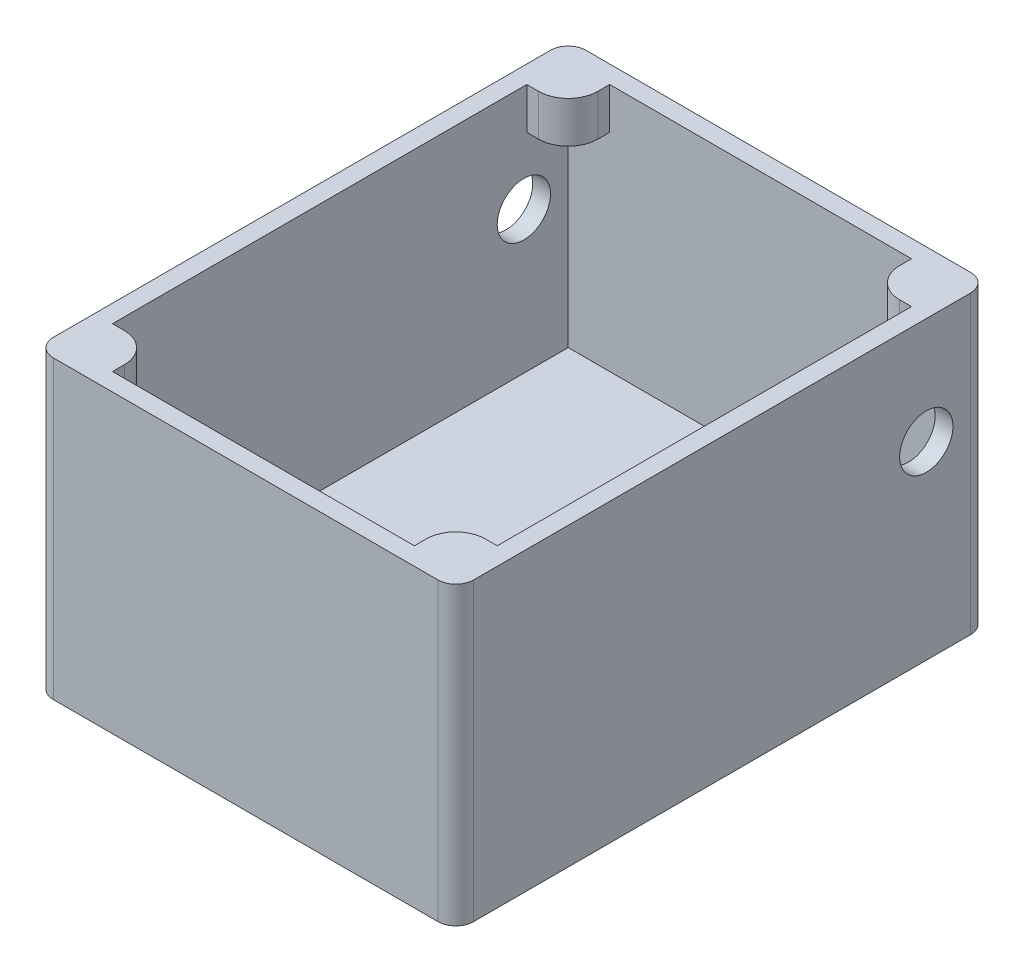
from build123d import *

# Parameters (mm, degrees)
SKETCH1_W               = 71
SKETCH1_H               = 90
BOSS_EXTRUDE1_DEPTH     = 50
SKETCH2_W               = 65
SKETCH2_H               = 84
CUT_EXTRUDE1_DEPTH      = 47
SKETCH3_W               = 51
SKETCH3_H               = 62.5
BOSS_EXTRUDE2_DEPTH     = 5
CUT_EXTRUDE2_DEPTH      = 104.847243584
CUT_EXTRUDE2_DEPTH_BACK = 104.847243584
SKETCH4_R               = 4.5
SKETCH5_W               = 10
SKETCH5_H               = 10
BOSS_EXTRUDE3_DEPTH     = 7
FILLET3_R               = 3
FILLET4_R               = 3
FILLET5_R               = 3
FILLET6_R               = 3
FILLET7_R               = 5
FILLET8_R               = 5
FILLET9_R               = 5
FILLET10_R              = 5


with BuildPart() as part:
    # Sketch1 → Boss-Extrude1 (new body)
    with BuildSketch(Plane(origin=(0, 0, 0), x_dir=(1, 0, 0), z_dir=(0, 1, 0))):
        with Locations((-29.196168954, -15.5)):
            Rectangle(SKETCH1_W, SKETCH1_H)
    extrude(amount=BOSS_EXTRUDE1_DEPTH)

    # Sketch2 → Cut-Extrude1 (cut)
    with BuildSketch(Plane(origin=(0, 50, 0), x_dir=(1, 0, 0), z_dir=(0, 1, 0))):
        with Locations((-29.196168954, -15.5)):
            Rectangle(SKETCH2_W, SKETCH2_H)
    extrude(amount=-CUT_EXTRUDE1_DEPTH, mode=Mode.SUBTRACT)

    # Sketch3 → Boss-Extrude2 (add)
    with BuildSketch(Plane(origin=(0, 3, 0), x_dir=(1, 0, 0), z_dir=(0, 1, 0))):
        with Locations((-36.196168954, -4.75)):
            Rectangle(SKETCH3_W, SKETCH3_H)
    extrude(amount=BOSS_EXTRUDE2_DEPTH)

    # Sketch4 → Cut-Extrude2 (cut, two sides: drawn at the far end of the back side and taken through both)
    with BuildSketch(Plane(origin=(-61.696168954, 0, 0), x_dir=(0, 0, -1), z_dir=(1, 0, 0)).offset(-CUT_EXTRUDE2_DEPTH_BACK)):
        with Locations((19, 32)):
            Circle(SKETCH4_R)
    extrude(amount=CUT_EXTRUDE2_DEPTH + CUT_EXTRUDE2_DEPTH_BACK, mode=Mode.SUBTRACT)

    # Sketch5 → Boss-Extrude3 (add)
    with BuildSketch(Plane(origin=(0, 50, 0), x_dir=(1, 0, 0), z_dir=(0, 1, 0))):
        with Locations((-59.696168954, -55.5)):
            Rectangle(SKETCH5_W, SKETCH5_H)
        with Locations((1.303831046, -55.5)):
            Rectangle(SKETCH5_W, SKETCH5_H)
        with Locations((1.303831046, 24.5)):
            Rectangle(SKETCH5_W, SKETCH5_H)
        with Locations((-59.696168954, 24.5)):
            Rectangle(SKETCH5_W, SKETCH5_H)
    extrude(amount=-BOSS_EXTRUDE3_DEPTH)

    # Fillet3
    fillet3_edges = [part.edges().sort_by_distance(p)[0] for p in [
        (-64.696168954, 25, -29.5),
    ]]
    fillet(fillet3_edges, radius=FILLET3_R)

    # Fillet4
    fillet4_edges = [part.edges().sort_by_distance(p)[0] for p in [
        (6.303831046, 25, -29.5),
    ]]
    fillet(fillet4_edges, radius=FILLET4_R)

    # Fillet5
    fillet5_edges = [part.edges().sort_by_distance(p)[0] for p in [
        (6.303831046, 25, 60.5),
    ]]
    fillet(fillet5_edges, radius=FILLET5_R)

    # Fillet6
    fillet6_edges = [part.edges().sort_by_distance(p)[0] for p in [
        (-64.696168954, 25, 60.5),
    ]]
    fillet(fillet6_edges, radius=FILLET6_R)

    # Fillet7
    fillet7_edges = [part.edges().sort_by_distance(p)[0] for p in [
        (-54.696168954, 46.5, -19.5),
    ]]
    fillet(fillet7_edges, radius=FILLET7_R)

    # Fillet8
    fillet8_edges = [part.edges().sort_by_distance(p)[0] for p in [
        (-3.696168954, 46.5, -19.5),
    ]]
    fillet(fillet8_edges, radius=FILLET8_R)

    # Fillet9
    fillet9_edges = [part.edges().sort_by_distance(p)[0] for p in [
        (-54.696168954, 46.5, 50.5),
    ]]
    fillet(fillet9_edges, radius=FILLET9_R)

    # Fillet10
    fillet10_edges = [part.edges().sort_by_distance(p)[0] for p in [
        (-3.696168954, 46.5, 50.5),
    ]]
    fillet(fillet10_edges, radius=FILLET10_R)


solid = part.part
